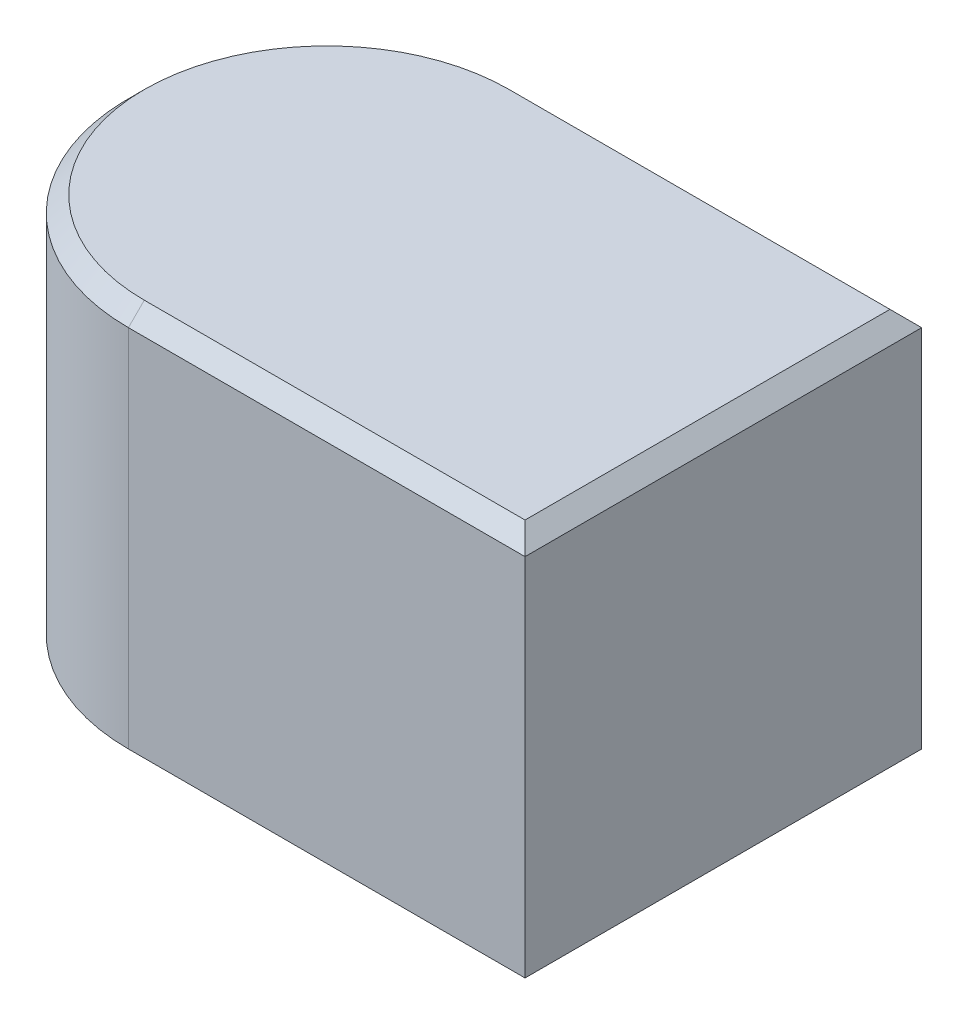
ISO-10303-21;
HEADER;
FILE_DESCRIPTION(('STEP AP214'),'2;1');
FILE_NAME('part.step','',(''),(''),'','','');
FILE_SCHEMA(('AUTOMOTIVE_DESIGN { 1 0 10303 214 1 1 1 1 }'));
ENDSEC;
DATA;
#1=APPLICATION_CONTEXT('core data for automotive mechanical design processes');
#2=APPLICATION_PROTOCOL_DEFINITION('international standard','automotive_design',2000,#1);
#3=PRODUCT_CONTEXT('',#1,'mechanical');
#4=PRODUCT('Part','Part','',(#3));
#5=PRODUCT_RELATED_PRODUCT_CATEGORY('part','',(#4));
#6=PRODUCT_DEFINITION_FORMATION('','',#4);
#7=PRODUCT_DEFINITION_CONTEXT('part definition',#1,'design');
#8=PRODUCT_DEFINITION('design','',#6,#7);
#9=PRODUCT_DEFINITION_SHAPE('','',#8);
#10=(LENGTH_UNIT() NAMED_UNIT(*) SI_UNIT(.MILLI.,.METRE.));
#11=(NAMED_UNIT(*) PLANE_ANGLE_UNIT() SI_UNIT($,.RADIAN.));
#12=(NAMED_UNIT(*) SI_UNIT($,.STERADIAN.) SOLID_ANGLE_UNIT());
#13=UNCERTAINTY_MEASURE_WITH_UNIT(LENGTH_MEASURE(1.E-05),#10,'distance_accuracy_value','');
#14=(GEOMETRIC_REPRESENTATION_CONTEXT(3) GLOBAL_UNCERTAINTY_ASSIGNED_CONTEXT((#13)) GLOBAL_UNIT_ASSIGNED_CONTEXT((#10,
#11,#12)) REPRESENTATION_CONTEXT('',''));
#15=CARTESIAN_POINT('',(0.,0.,0.));
#16=DIRECTION('',(0.,0.,1.));
#17=DIRECTION('',(1.,0.,0.));
#18=AXIS2_PLACEMENT_3D('',#15,#16,#17);
#19=CARTESIAN_POINT('',(0.,4.,0.));
#20=DIRECTION('',(0.,-1.,0.));
#21=DIRECTION('',(0.,0.,-1.));
#22=AXIS2_PLACEMENT_3D('',#19,#20,#21);
#23=CYLINDRICAL_SURFACE('',#22,2.);
#24=DIRECTION('',(0.,-1.,0.));
#25=VECTOR('',#24,1.);
#26=CARTESIAN_POINT('',(0.,4.,2.));
#27=LINE('',#26,#25);
#28=CARTESIAN_POINT('',(0.,3.84,2.));
#29=VERTEX_POINT('',#28);
#30=CARTESIAN_POINT('',(0.,0.160000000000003,2.));
#31=VERTEX_POINT('',#30);
#32=EDGE_CURVE('E431',#29,#31,#27,.T.);
#33=ORIENTED_EDGE('',*,*,#32,.F.);
#34=CARTESIAN_POINT('',(0.,3.84,0.));
#35=DIRECTION('',(0.,1.,0.));
#36=DIRECTION('',(0.,0.,1.));
#37=AXIS2_PLACEMENT_3D('',#34,#35,#36);
#38=CIRCLE('',#37,2.);
#39=CARTESIAN_POINT('',(0.,3.84,-2.));
#40=VERTEX_POINT('',#39);
#41=EDGE_CURVE('E455',#29,#40,#38,.F.);
#42=ORIENTED_EDGE('',*,*,#41,.T.);
#43=DIRECTION('',(0.,-1.,0.));
#44=VECTOR('',#43,1.);
#45=CARTESIAN_POINT('',(0.,4.,-2.));
#46=LINE('',#45,#44);
#47=CARTESIAN_POINT('',(0.,0.160000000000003,-2.));
#48=VERTEX_POINT('',#47);
#49=EDGE_CURVE('E482',#40,#48,#46,.T.);
#50=ORIENTED_EDGE('',*,*,#49,.T.);
#51=CARTESIAN_POINT('',(0.,0.160000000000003,0.));
#52=DIRECTION('',(0.,1.,0.));
#53=DIRECTION('',(0.,0.,1.));
#54=AXIS2_PLACEMENT_3D('',#51,#52,#53);
#55=CIRCLE('',#54,2.);
#56=EDGE_CURVE('E453',#48,#31,#55,.T.);
#57=ORIENTED_EDGE('',*,*,#56,.T.);
#58=EDGE_LOOP('',(#33,#42,#50,#57));
#59=FACE_BOUND('',#58,.T.);
#60=ADVANCED_FACE('F348',(#59),#23,.T.);
#61=CARTESIAN_POINT('',(4.,4.,2.));
#62=DIRECTION('',(0.,0.,-1.));
#63=DIRECTION('',(-1.,0.,0.));
#64=AXIS2_PLACEMENT_3D('',#61,#62,#63);
#65=PLANE('',#64);
#66=DIRECTION('',(0.,-1.,0.));
#67=VECTOR('',#66,1.);
#68=CARTESIAN_POINT('',(4.,4.,2.));
#69=LINE('',#68,#67);
#70=CARTESIAN_POINT('',(4.,3.84,2.));
#71=VERTEX_POINT('',#70);
#72=CARTESIAN_POINT('',(4.,0.160000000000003,2.));
#73=VERTEX_POINT('',#72);
#74=EDGE_CURVE('E488',#71,#73,#69,.T.);
#75=ORIENTED_EDGE('',*,*,#74,.F.);
#76=DIRECTION('',(-1.,0.,0.));
#77=VECTOR('',#76,1.);
#78=CARTESIAN_POINT('',(0.,3.84,2.));
#79=LINE('',#78,#77);
#80=EDGE_CURVE('E451',#71,#29,#79,.T.);
#81=ORIENTED_EDGE('',*,*,#80,.T.);
#82=ORIENTED_EDGE('',*,*,#32,.T.);
#83=DIRECTION('',(1.,0.,0.));
#84=VECTOR('',#83,1.);
#85=CARTESIAN_POINT('',(4.,0.160000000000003,2.));
#86=LINE('',#85,#84);
#87=EDGE_CURVE('E448',#31,#73,#86,.T.);
#88=ORIENTED_EDGE('',*,*,#87,.T.);
#89=EDGE_LOOP('',(#75,#81,#82,#88));
#90=FACE_BOUND('',#89,.T.);
#91=ADVANCED_FACE('F513',(#90),#65,.F.);
#92=CARTESIAN_POINT('',(4.,4.,2.));
#93=DIRECTION('',(-1.,0.,0.));
#94=DIRECTION('',(0.,0.,1.));
#95=AXIS2_PLACEMENT_3D('',#92,#93,#94);
#96=PLANE('',#95);
#97=DIRECTION('',(0.,-1.,0.));
#98=VECTOR('',#97,1.);
#99=CARTESIAN_POINT('',(4.,4.,-2.));
#100=LINE('',#99,#98);
#101=CARTESIAN_POINT('',(4.,3.84,-2.));
#102=VERTEX_POINT('',#101);
#103=CARTESIAN_POINT('',(4.,0.160000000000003,-2.));
#104=VERTEX_POINT('',#103);
#105=EDGE_CURVE('E485',#102,#104,#100,.T.);
#106=ORIENTED_EDGE('',*,*,#105,.F.);
#107=DIRECTION('',(0.,0.,1.));
#108=VECTOR('',#107,1.);
#109=CARTESIAN_POINT('',(4.,3.84,2.));
#110=LINE('',#109,#108);
#111=EDGE_CURVE('E446',#102,#71,#110,.T.);
#112=ORIENTED_EDGE('',*,*,#111,.T.);
#113=ORIENTED_EDGE('',*,*,#74,.T.);
#114=DIRECTION('',(0.,0.,-1.));
#115=VECTOR('',#114,1.);
#116=CARTESIAN_POINT('',(4.,0.160000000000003,2.));
#117=LINE('',#116,#115);
#118=EDGE_CURVE('E444',#73,#104,#117,.T.);
#119=ORIENTED_EDGE('',*,*,#118,.T.);
#120=EDGE_LOOP('',(#106,#112,#113,#119));
#121=FACE_BOUND('',#120,.T.);
#122=ADVANCED_FACE('F505',(#121),#96,.F.);
#123=CARTESIAN_POINT('',(4.,4.,-2.));
#124=DIRECTION('',(0.,0.,1.));
#125=DIRECTION('',(1.,0.,0.));
#126=AXIS2_PLACEMENT_3D('',#123,#124,#125);
#127=PLANE('',#126);
#128=ORIENTED_EDGE('',*,*,#49,.F.);
#129=DIRECTION('',(1.,0.,0.));
#130=VECTOR('',#129,1.);
#131=CARTESIAN_POINT('',(4.,3.84,-2.));
#132=LINE('',#131,#130);
#133=EDGE_CURVE('E417',#40,#102,#132,.T.);
#134=ORIENTED_EDGE('',*,*,#133,.T.);
#135=ORIENTED_EDGE('',*,*,#105,.T.);
#136=DIRECTION('',(-1.,0.,0.));
#137=VECTOR('',#136,1.);
#138=CARTESIAN_POINT('',(4.,0.160000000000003,-2.));
#139=LINE('',#138,#137);
#140=EDGE_CURVE('E437',#104,#48,#139,.T.);
#141=ORIENTED_EDGE('',*,*,#140,.T.);
#142=EDGE_LOOP('',(#128,#134,#135,#141));
#143=FACE_BOUND('',#142,.T.);
#144=ADVANCED_FACE('F504',(#143),#127,.F.);
#145=CARTESIAN_POINT('',(0.,4.,0.));
#146=DIRECTION('',(0.,1.,0.));
#147=DIRECTION('',(0.,0.,1.));
#148=AXIS2_PLACEMENT_3D('',#145,#146,#147);
#149=PLANE('',#148);
#150=DIRECTION('',(0.,0.,-1.));
#151=VECTOR('',#150,1.);
#152=CARTESIAN_POINT('',(3.84,4.,-2.));
#153=LINE('',#152,#151);
#154=CARTESIAN_POINT('',(3.84,4.,1.84));
#155=VERTEX_POINT('',#154);
#156=CARTESIAN_POINT('',(3.84,4.,-1.84));
#157=VERTEX_POINT('',#156);
#158=EDGE_CURVE('E435',#155,#157,#153,.T.);
#159=ORIENTED_EDGE('',*,*,#158,.T.);
#160=DIRECTION('',(-1.,0.,0.));
#161=VECTOR('',#160,1.);
#162=CARTESIAN_POINT('',(0.,4.,-1.84));
#163=LINE('',#162,#161);
#164=CARTESIAN_POINT('',(0.,4.,-1.84));
#165=VERTEX_POINT('',#164);
#166=EDGE_CURVE('E415',#157,#165,#163,.T.);
#167=ORIENTED_EDGE('',*,*,#166,.T.);
#168=CARTESIAN_POINT('',(0.,4.,0.));
#169=DIRECTION('',(0.,1.,0.));
#170=DIRECTION('',(0.,0.,1.));
#171=AXIS2_PLACEMENT_3D('',#168,#169,#170);
#172=CIRCLE('',#171,1.84);
#173=CARTESIAN_POINT('',(0.,4.,1.84));
#174=VERTEX_POINT('',#173);
#175=EDGE_CURVE('E424',#165,#174,#172,.T.);
#176=ORIENTED_EDGE('',*,*,#175,.T.);
#177=DIRECTION('',(1.,0.,0.));
#178=VECTOR('',#177,1.);
#179=CARTESIAN_POINT('',(4.,4.,1.84));
#180=LINE('',#179,#178);
#181=EDGE_CURVE('E430',#174,#155,#180,.T.);
#182=ORIENTED_EDGE('',*,*,#181,.T.);
#183=EDGE_LOOP('',(#159,#167,#176,#182));
#184=FACE_BOUND('',#183,.T.);
#185=ADVANCED_FACE('F433',(#184),#149,.T.);
#186=CARTESIAN_POINT('',(0.,0.,0.));
#187=DIRECTION('',(0.,1.,0.));
#188=DIRECTION('',(0.,0.,1.));
#189=AXIS2_PLACEMENT_3D('',#186,#187,#188);
#190=PLANE('',#189);
#191=DIRECTION('',(0.,0.,1.));
#192=VECTOR('',#191,1.);
#193=CARTESIAN_POINT('',(3.84,0.,0.));
#194=LINE('',#193,#192);
#195=CARTESIAN_POINT('',(3.84,0.,-1.84));
#196=VERTEX_POINT('',#195);
#197=CARTESIAN_POINT('',(3.84,0.,1.84));
#198=VERTEX_POINT('',#197);
#199=EDGE_CURVE('E355',#196,#198,#194,.T.);
#200=ORIENTED_EDGE('',*,*,#199,.T.);
#201=DIRECTION('',(-1.,0.,0.));
#202=VECTOR('',#201,1.);
#203=CARTESIAN_POINT('',(0.,0.,1.84));
#204=LINE('',#203,#202);
#205=CARTESIAN_POINT('',(0.,0.,1.84));
#206=VERTEX_POINT('',#205);
#207=EDGE_CURVE('E11',#198,#206,#204,.T.);
#208=ORIENTED_EDGE('',*,*,#207,.T.);
#209=CARTESIAN_POINT('',(0.,0.,0.));
#210=DIRECTION('',(0.,1.,0.));
#211=DIRECTION('',(0.,0.,1.));
#212=AXIS2_PLACEMENT_3D('',#209,#210,#211);
#213=CIRCLE('',#212,1.84);
#214=CARTESIAN_POINT('',(0.,0.,-1.84));
#215=VERTEX_POINT('',#214);
#216=EDGE_CURVE('E457',#206,#215,#213,.F.);
#217=ORIENTED_EDGE('',*,*,#216,.T.);
#218=DIRECTION('',(1.,0.,0.));
#219=VECTOR('',#218,1.);
#220=CARTESIAN_POINT('',(0.,0.,-1.84));
#221=LINE('',#220,#219);
#222=EDGE_CURVE('E365',#215,#196,#221,.T.);
#223=ORIENTED_EDGE('',*,*,#222,.T.);
#224=EDGE_LOOP('',(#200,#208,#217,#223));
#225=FACE_BOUND('',#224,.T.);
#226=ADVANCED_FACE('F460',(#225),#190,.F.);
#227=CARTESIAN_POINT('',(0.,4.,1.84));
#228=DIRECTION('',(0.,0.707106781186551,0.707106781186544));
#229=DIRECTION('',(0.,-0.707106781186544,0.707106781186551));
#230=AXIS2_PLACEMENT_3D('',#227,#228,#229);
#231=PLANE('',#230);
#232=DIRECTION('',(0.,0.707106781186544,-0.707106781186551));
#233=VECTOR('',#232,1.);
#234=CARTESIAN_POINT('',(0.,3.84,2.));
#235=LINE('',#234,#233);
#236=EDGE_CURVE('E427',#29,#174,#235,.T.);
#237=ORIENTED_EDGE('',*,*,#236,.F.);
#238=ORIENTED_EDGE('',*,*,#80,.F.);
#239=DIRECTION('',(-0.577350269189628,0.577350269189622,-0.577350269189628));
#240=VECTOR('',#239,1.);
#241=CARTESIAN_POINT('',(2.55999999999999,5.28,0.559999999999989));
#242=LINE('',#241,#240);
#243=EDGE_CURVE('E479',#155,#71,#242,.F.);
#244=ORIENTED_EDGE('',*,*,#243,.F.);
#245=ORIENTED_EDGE('',*,*,#181,.F.);
#246=EDGE_LOOP('',(#237,#238,#244,#245));
#247=FACE_BOUND('',#246,.T.);
#248=ADVANCED_FACE('F495',(#247),#231,.T.);
#249=CARTESIAN_POINT('',(3.84,4.,0.));
#250=DIRECTION('',(0.707106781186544,0.707106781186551,0.));
#251=DIRECTION('',(-0.707106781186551,0.707106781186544,0.));
#252=AXIS2_PLACEMENT_3D('',#249,#250,#251);
#253=PLANE('',#252);
#254=ORIENTED_EDGE('',*,*,#243,.T.);
#255=ORIENTED_EDGE('',*,*,#111,.F.);
#256=DIRECTION('',(-0.577350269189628,0.577350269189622,0.577350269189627));
#257=VECTOR('',#256,1.);
#258=CARTESIAN_POINT('',(3.22666666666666,4.61333333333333,-1.22666666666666));
#259=LINE('',#258,#257);
#260=EDGE_CURVE('E420',#157,#102,#259,.F.);
#261=ORIENTED_EDGE('',*,*,#260,.F.);
#262=ORIENTED_EDGE('',*,*,#158,.F.);
#263=EDGE_LOOP('',(#254,#255,#261,#262));
#264=FACE_BOUND('',#263,.T.);
#265=ADVANCED_FACE('F498',(#264),#253,.T.);
#266=CARTESIAN_POINT('',(0.,4.,0.));
#267=DIRECTION('',(0.,-1.,0.));
#268=DIRECTION('',(0.,0.,-1.));
#269=AXIS2_PLACEMENT_3D('',#266,#267,#268);
#270=CONICAL_SURFACE('',#269,1.84,0.785398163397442);
#271=ORIENTED_EDGE('',*,*,#236,.T.);
#272=ORIENTED_EDGE('',*,*,#175,.F.);
#273=DIRECTION('',(0.,0.707106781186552,0.707106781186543));
#274=VECTOR('',#273,1.);
#275=CARTESIAN_POINT('',(0.,3.84,-2.));
#276=LINE('',#275,#274);
#277=EDGE_CURVE('E411',#40,#165,#276,.T.);
#278=ORIENTED_EDGE('',*,*,#277,.F.);
#279=ORIENTED_EDGE('',*,*,#41,.F.);
#280=EDGE_LOOP('',(#271,#272,#278,#279));
#281=FACE_BOUND('',#280,.T.);
#282=ADVANCED_FACE('F425',(#281),#270,.T.);
#283=CARTESIAN_POINT('',(0.,4.,-1.84));
#284=DIRECTION('',(0.,0.707106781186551,-0.707106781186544));
#285=DIRECTION('',(0.,0.707106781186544,0.707106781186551));
#286=AXIS2_PLACEMENT_3D('',#283,#284,#285);
#287=PLANE('',#286);
#288=ORIENTED_EDGE('',*,*,#260,.T.);
#289=ORIENTED_EDGE('',*,*,#133,.F.);
#290=ORIENTED_EDGE('',*,*,#277,.T.);
#291=ORIENTED_EDGE('',*,*,#166,.F.);
#292=EDGE_LOOP('',(#288,#289,#290,#291));
#293=FACE_BOUND('',#292,.T.);
#294=ADVANCED_FACE('F413',(#293),#287,.T.);
#295=CARTESIAN_POINT('',(4.,0.160000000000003,-2.));
#296=DIRECTION('',(0.,0.707106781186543,0.707106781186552));
#297=DIRECTION('',(0.,-0.707106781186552,0.707106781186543));
#298=AXIS2_PLACEMENT_3D('',#295,#296,#297);
#299=PLANE('',#298);
#300=DIRECTION('',(-0.577350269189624,-0.57735026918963,0.577350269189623));
#301=VECTOR('',#300,1.);
#302=CARTESIAN_POINT('',(4.,0.160000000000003,-2.));
#303=LINE('',#302,#301);
#304=EDGE_CURVE('E470',#196,#104,#303,.F.);
#305=ORIENTED_EDGE('',*,*,#304,.F.);
#306=ORIENTED_EDGE('',*,*,#222,.F.);
#307=DIRECTION('',(0.,-0.707106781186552,0.707106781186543));
#308=VECTOR('',#307,1.);
#309=CARTESIAN_POINT('',(0.,0.160000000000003,-2.));
#310=LINE('',#309,#308);
#311=EDGE_CURVE('E421',#48,#215,#310,.T.);
#312=ORIENTED_EDGE('',*,*,#311,.F.);
#313=ORIENTED_EDGE('',*,*,#140,.F.);
#314=EDGE_LOOP('',(#305,#306,#312,#313));
#315=FACE_BOUND('',#314,.T.);
#316=ADVANCED_FACE('F466',(#315),#299,.F.);
#317=CARTESIAN_POINT('',(0.,0.160000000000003,0.));
#318=DIRECTION('',(0.,1.,0.));
#319=DIRECTION('',(0.,0.,1.));
#320=AXIS2_PLACEMENT_3D('',#317,#318,#319);
#321=CONICAL_SURFACE('',#320,2.,0.785398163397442);
#322=ORIENTED_EDGE('',*,*,#311,.T.);
#323=ORIENTED_EDGE('',*,*,#216,.F.);
#324=DIRECTION('',(0.,-0.707106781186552,-0.707106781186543));
#325=VECTOR('',#324,1.);
#326=CARTESIAN_POINT('',(0.,0.160000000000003,2.));
#327=LINE('',#326,#325);
#328=EDGE_CURVE('E473',#31,#206,#327,.T.);
#329=ORIENTED_EDGE('',*,*,#328,.F.);
#330=ORIENTED_EDGE('',*,*,#56,.F.);
#331=EDGE_LOOP('',(#322,#323,#329,#330));
#332=FACE_BOUND('',#331,.T.);
#333=ADVANCED_FACE('F471',(#332),#321,.T.);
#334=CARTESIAN_POINT('',(4.,0.160000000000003,2.));
#335=DIRECTION('',(-0.707106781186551,0.707106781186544,0.));
#336=DIRECTION('',(-0.707106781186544,-0.707106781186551,0.));
#337=AXIS2_PLACEMENT_3D('',#334,#335,#336);
#338=PLANE('',#337);
#339=ORIENTED_EDGE('',*,*,#304,.T.);
#340=ORIENTED_EDGE('',*,*,#118,.F.);
#341=DIRECTION('',(-0.577350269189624,-0.57735026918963,-0.577350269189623));
#342=VECTOR('',#341,1.);
#343=CARTESIAN_POINT('',(4.,0.160000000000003,2.));
#344=LINE('',#343,#342);
#345=EDGE_CURVE('E510',#198,#73,#344,.F.);
#346=ORIENTED_EDGE('',*,*,#345,.F.);
#347=ORIENTED_EDGE('',*,*,#199,.F.);
#348=EDGE_LOOP('',(#339,#340,#346,#347));
#349=FACE_BOUND('',#348,.T.);
#350=ADVANCED_FACE('F509',(#349),#338,.F.);
#351=CARTESIAN_POINT('',(4.,0.160000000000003,2.));
#352=DIRECTION('',(0.,0.707106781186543,-0.707106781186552));
#353=DIRECTION('',(0.,0.707106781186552,0.707106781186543));
#354=AXIS2_PLACEMENT_3D('',#351,#352,#353);
#355=PLANE('',#354);
#356=ORIENTED_EDGE('',*,*,#328,.T.);
#357=ORIENTED_EDGE('',*,*,#207,.F.);
#358=ORIENTED_EDGE('',*,*,#345,.T.);
#359=ORIENTED_EDGE('',*,*,#87,.F.);
#360=EDGE_LOOP('',(#356,#357,#358,#359));
#361=FACE_BOUND('',#360,.T.);
#362=ADVANCED_FACE('F516',(#361),#355,.F.);
#363=CLOSED_SHELL('',(#60,#91,#122,#144,#185,#226,#248,#265,#282,#294,#316,#333,#350,#362));
#364=MANIFOLD_SOLID_BREP('B2',#363);
#365=ADVANCED_BREP_SHAPE_REPRESENTATION('',(#18,#364),#14);
#366=SHAPE_DEFINITION_REPRESENTATION(#9,#365);
ENDSEC;
END-ISO-10303-21;
